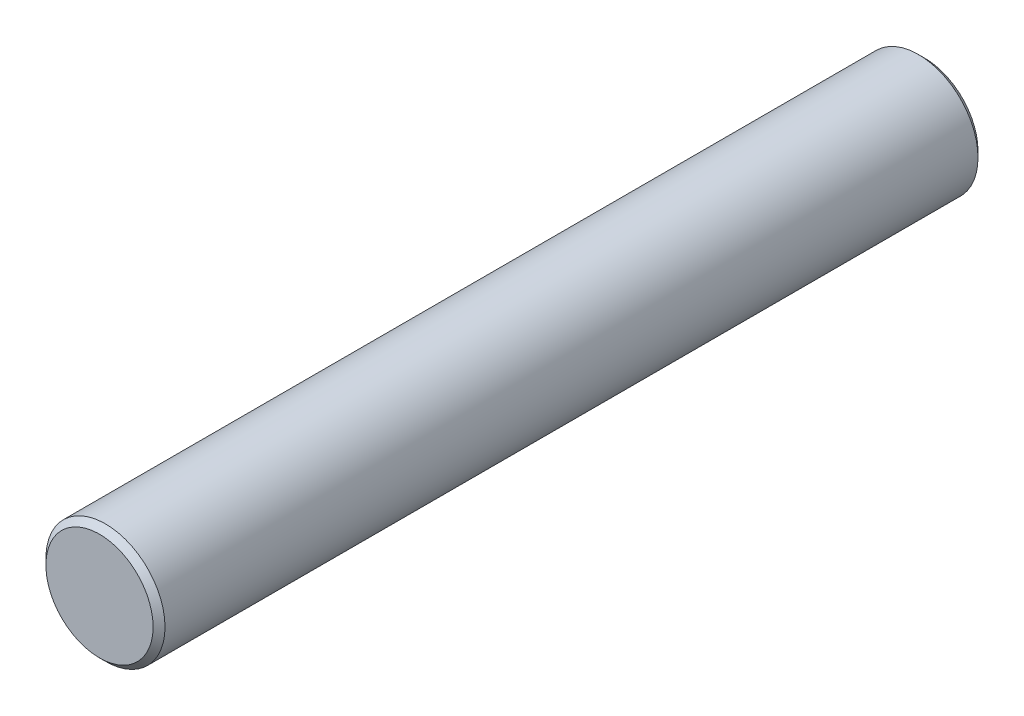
from build123d import *


with BuildPart() as part:
    # Esquisse1 → R_volution1 (revolve)
    with BuildSketch(Plane(origin=(0, 0, 0), x_dir=(1, 0, 0), z_dir=(0, 1, 0))):
        Polygon((7, 88.5), (0, 84.293975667), (0, -138.5), (18, -138.5), (20, -136.5), (20, 136.5), (18, 138.5), (7, 138.5), align=None)
    revolve(axis=Axis((0, 0, -138.5), (0, 0, 1)))


solid = part.part
